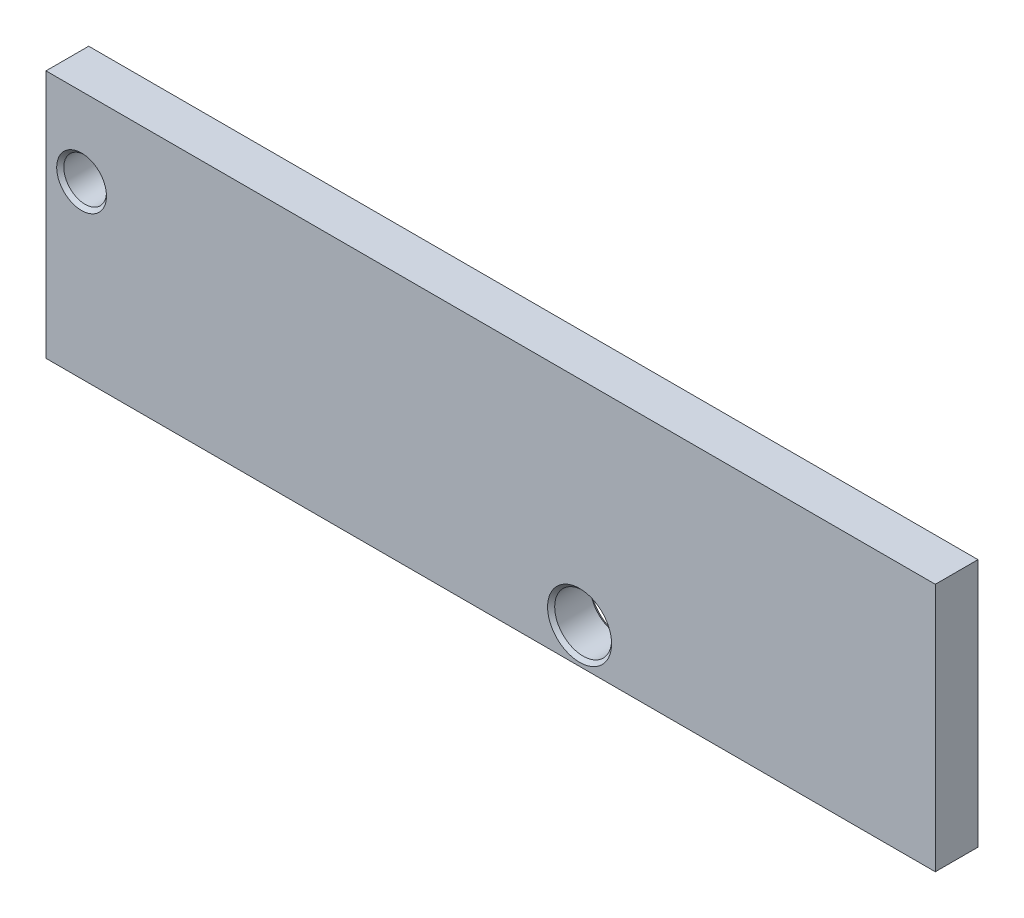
from build123d import *

# Parameters (mm, degrees)
ESQUISSE1_W               = 250
ESQUISSE1_H               = 70
EXTRUSION1_DEPTH          = 12
ENL_V_MAT_EXTRU_1_REACH   = 164
ESQUISSE3_R               = 8
ESQUISSE3_R_2             = 6
CHANFREIN1_SIZE           = 1
TROU_TARAUD_M5X0_81_D     = 4.2
TROU_TARAUD_M5X0_81_DEPTH = 12.4
TROU_TARAUD_M5X0_81_TIP   = 1.2618073


with BuildPart() as part:
    # Esquisse1 → Extrusion1 (new body)
    with BuildSketch(Plane.XY.offset(60)):
        with Locations((-25, 25)):
            Rectangle(ESQUISSE1_W, ESQUISSE1_H)
    extrude(amount=EXTRUSION1_DEPTH)

    # Esquisse3 → Enl_v. mat.-Extru.1 (cut, up to next)
    with BuildSketch(Plane.XY.offset(72), mode=Mode.PRIVATE) as enl_v_mat_extru_1_sk1:
        Circle(ESQUISSE3_R)
    enl_v_mat_extru_1_tool1 = extrude(enl_v_mat_extru_1_sk1.sketch, amount=-ENL_V_MAT_EXTRU_1_REACH, mode=Mode.PRIVATE) & part.part
    # Esquisse3 → Enl_v. mat.-Extru.1 (cut, up to next)
    with BuildSketch(Plane.XY.offset(72), mode=Mode.PRIVATE) as enl_v_mat_extru_1_sk2:
        with Locations((-140, 38)):
            Circle(ESQUISSE3_R_2)
    enl_v_mat_extru_1_tool2 = extrude(enl_v_mat_extru_1_sk2.sketch, amount=-ENL_V_MAT_EXTRU_1_REACH, mode=Mode.PRIVATE) & part.part
    add(enl_v_mat_extru_1_tool1.solids().sort_by_distance((0, 0, 72))[0], mode=Mode.SUBTRACT)
    add(enl_v_mat_extru_1_tool2.solids().sort_by_distance((-140, 38, 72))[0], mode=Mode.SUBTRACT)

    # Chanfrein1
    chanfrein1_edges = [part.edges().sort_by_distance(p)[0] for p in [
        (-8, 0, 60),
        (-8, 0, 72),
        (-146, 38, 60),
        (-146, 38, 72),
    ]]
    chamfer(chanfrein1_edges, length=CHANFREIN1_SIZE)

    # Trou taraud_ M5x0.81
    with Locations(Plane.XZ.offset(10)):
        with Locations((50, 66), (80, 66)):
            Hole(TROU_TARAUD_M5X0_81_D / 2, depth=TROU_TARAUD_M5X0_81_DEPTH)
            with Locations((0, 0, -(TROU_TARAUD_M5X0_81_DEPTH + TROU_TARAUD_M5X0_81_TIP / 2))):  # 118° drill point
                Cone(0, TROU_TARAUD_M5X0_81_D / 2, TROU_TARAUD_M5X0_81_TIP, mode=Mode.SUBTRACT)


solid = part.part
